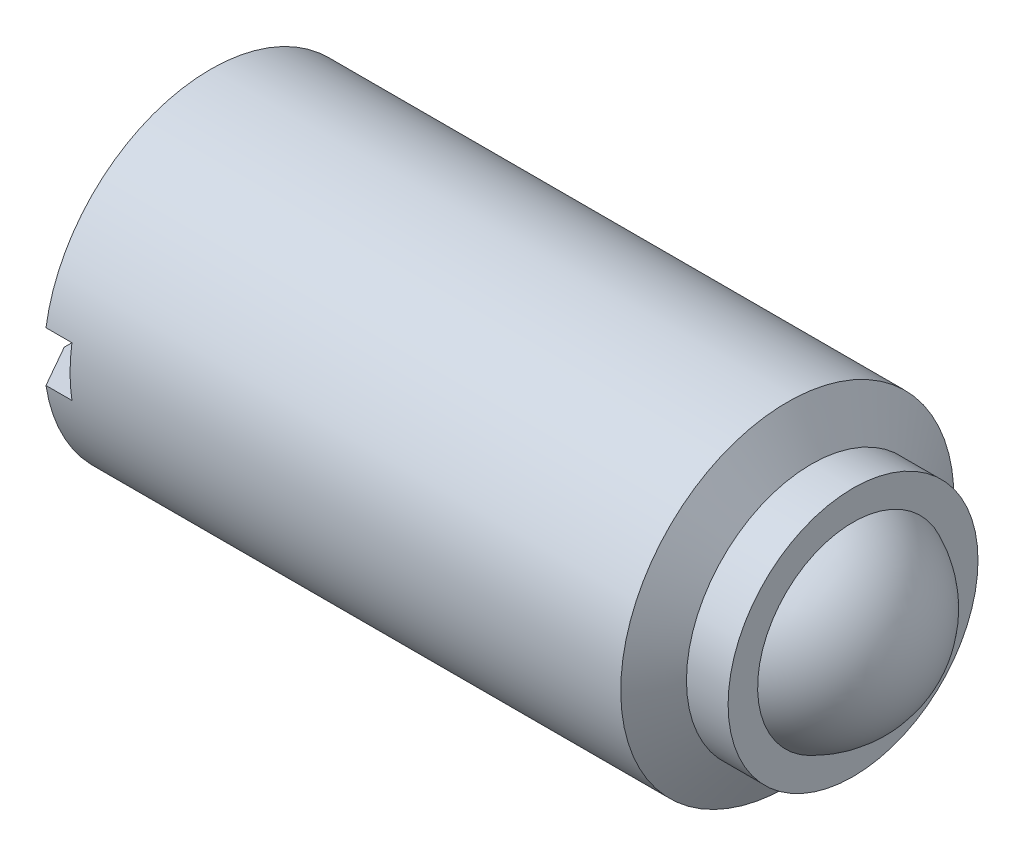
ISO-10303-21;
HEADER;
FILE_DESCRIPTION(('STEP AP214'),'2;1');
FILE_NAME('part.step','',(''),(''),'','','');
FILE_SCHEMA(('AUTOMOTIVE_DESIGN { 1 0 10303 214 1 1 1 1 }'));
ENDSEC;
DATA;
#1=APPLICATION_CONTEXT('core data for automotive mechanical design processes');
#2=APPLICATION_PROTOCOL_DEFINITION('international standard','automotive_design',2000,#1);
#3=PRODUCT_CONTEXT('',#1,'mechanical');
#4=PRODUCT('Part','Part','',(#3));
#5=PRODUCT_RELATED_PRODUCT_CATEGORY('part','',(#4));
#6=PRODUCT_DEFINITION_FORMATION('','',#4);
#7=PRODUCT_DEFINITION_CONTEXT('part definition',#1,'design');
#8=PRODUCT_DEFINITION('design','',#6,#7);
#9=PRODUCT_DEFINITION_SHAPE('','',#8);
#10=(LENGTH_UNIT() NAMED_UNIT(*) SI_UNIT(.MILLI.,.METRE.));
#11=(NAMED_UNIT(*) PLANE_ANGLE_UNIT() SI_UNIT($,.RADIAN.));
#12=(NAMED_UNIT(*) SI_UNIT($,.STERADIAN.) SOLID_ANGLE_UNIT());
#13=UNCERTAINTY_MEASURE_WITH_UNIT(LENGTH_MEASURE(1.E-05),#10,'distance_accuracy_value','');
#14=(GEOMETRIC_REPRESENTATION_CONTEXT(3) GLOBAL_UNCERTAINTY_ASSIGNED_CONTEXT((#13)) GLOBAL_UNIT_ASSIGNED_CONTEXT((#10,
#11,#12)) REPRESENTATION_CONTEXT('',''));
#15=CARTESIAN_POINT('',(0.,0.,0.));
#16=DIRECTION('',(0.,0.,1.));
#17=DIRECTION('',(1.,0.,0.));
#18=AXIS2_PLACEMENT_3D('',#15,#16,#17);
#19=CARTESIAN_POINT('',(0.,0.,0.));
#20=DIRECTION('',(1.,0.,0.));
#21=DIRECTION('',(0.,0.999999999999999,0.));
#22=AXIS2_PLACEMENT_3D('',#19,#20,#21);
#23=PLANE('',#22);
#24=CARTESIAN_POINT('',(0.,0.,0.));
#25=DIRECTION('',(-1.,0.,0.));
#26=DIRECTION('',(0.,-0.999999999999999,0.));
#27=AXIS2_PLACEMENT_3D('',#24,#25,#26);
#28=CIRCLE('',#27,3.);
#29=CARTESIAN_POINT('',(0.,-0.6,-2.93938769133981));
#30=VERTEX_POINT('',#29);
#31=CARTESIAN_POINT('',(0.,-0.600000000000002,2.93938769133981));
#32=VERTEX_POINT('',#31);
#33=EDGE_CURVE('E111',#30,#32,#28,.T.);
#34=ORIENTED_EDGE('',*,*,#33,.T.);
#35=DIRECTION('',(0.,0.,1.));
#36=VECTOR('',#35,1.);
#37=CARTESIAN_POINT('',(0.,-0.6,-4.));
#38=LINE('',#37,#36);
#39=EDGE_CURVE('E100',#30,#32,#38,.T.);
#40=ORIENTED_EDGE('',*,*,#39,.F.);
#41=EDGE_LOOP('',(#34,#40));
#42=FACE_BOUND('',#41,.T.);
#43=ADVANCED_FACE('F36',(#42),#23,.F.);
#44=CARTESIAN_POINT('',(0.577350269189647,0.,0.));
#45=DIRECTION('',(1.,0.,0.));
#46=DIRECTION('',(0.,0.999999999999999,0.));
#47=AXIS2_PLACEMENT_3D('',#44,#45,#46);
#48=CONICAL_SURFACE('',#47,4.,1.0471975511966);
#49=CARTESIAN_POINT('',(0.577350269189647,0.,0.));
#50=DIRECTION('',(-1.,0.,0.));
#51=DIRECTION('',(0.,-0.999999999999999,0.));
#52=AXIS2_PLACEMENT_3D('',#49,#50,#51);
#53=CIRCLE('',#52,4.);
#54=CARTESIAN_POINT('',(0.577350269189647,-0.599999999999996,-3.95474398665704));
#55=VERTEX_POINT('',#54);
#56=CARTESIAN_POINT('',(0.577350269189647,-0.599999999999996,3.95474398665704));
#57=VERTEX_POINT('',#56);
#58=EDGE_CURVE('E118',#55,#57,#53,.T.);
#59=ORIENTED_EDGE('',*,*,#58,.T.);
#60=CARTESIAN_POINT('',(3.36773334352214,-0.6,8.81268376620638));
#61=CARTESIAN_POINT('',(3.15323590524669,-0.6,8.44028772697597));
#62=CARTESIAN_POINT('',(2.93877319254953,-0.6,8.06787163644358));
#63=CARTESIAN_POINT('',(2.50999100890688,-0.6,7.32295456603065));
#64=CARTESIAN_POINT('',(2.29567153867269,-0.6,6.95045358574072));
#65=CARTESIAN_POINT('',(1.86728294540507,-0.6,6.20537988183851));
#66=CARTESIAN_POINT('',(1.65321379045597,-0.600000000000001,5.83280717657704));
#67=CARTESIAN_POINT('',(1.22544938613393,-0.6,5.0874490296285));
#68=CARTESIAN_POINT('',(1.01175413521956,-0.6,4.71466358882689));
#69=CARTESIAN_POINT('',(0.692608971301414,-0.6,4.1566266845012));
#70=CARTESIAN_POINT('',(0.586876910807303,-0.6,3.97153661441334));
#71=CARTESIAN_POINT('',(0.375692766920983,-0.600000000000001,3.60119447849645));
#72=CARTESIAN_POINT('',(0.270240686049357,-0.6,3.41594241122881));
#73=CARTESIAN_POINT('',(0.0597691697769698,-0.6,3.04516009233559));
#74=CARTESIAN_POINT('',(-0.0452502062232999,-0.600000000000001,2.85962980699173));
#75=CARTESIAN_POINT('',(-0.254533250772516,-0.6,2.48814806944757));
#76=CARTESIAN_POINT('',(-0.358796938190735,-0.6,2.30219662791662));
#77=CARTESIAN_POINT('',(-0.514209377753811,-0.6,2.02238544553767));
#78=CARTESIAN_POINT('',(-0.565920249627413,-0.6,1.92883819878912));
#79=CARTESIAN_POINT('',(-0.668771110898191,-0.600000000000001,1.74142204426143));
#80=CARTESIAN_POINT('',(-0.719911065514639,-0.6,1.64755311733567));
#81=CARTESIAN_POINT('',(-0.821277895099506,-0.6,1.45933909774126));
#82=CARTESIAN_POINT('',(-0.871504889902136,-0.600000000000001,1.36499406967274));
#83=CARTESIAN_POINT('',(-0.97043829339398,-0.6,1.175516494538));
#84=CARTESIAN_POINT('',(-1.0191449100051,-0.6,1.08038405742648));
#85=CARTESIAN_POINT('',(-1.0902361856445,-0.6,0.936159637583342));
#86=CARTESIAN_POINT('',(-1.11370740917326,-0.6,0.887606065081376));
#87=CARTESIAN_POINT('',(-1.15955218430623,-0.6,0.789985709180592));
#88=CARTESIAN_POINT('',(-1.18192581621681,-0.6,0.740918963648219));
#89=CARTESIAN_POINT('',(-1.22509408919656,-0.6,0.641927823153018));
#90=CARTESIAN_POINT('',(-1.24588444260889,-0.6,0.592001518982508));
#91=CARTESIAN_POINT('',(-1.28489458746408,-0.600000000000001,0.491175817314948));
#92=CARTESIAN_POINT('',(-1.30311523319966,-0.600000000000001,0.440276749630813));
#93=CARTESIAN_POINT('',(-1.34038989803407,-0.600000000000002,0.321497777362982));
#94=CARTESIAN_POINT('',(-1.35803657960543,-0.600000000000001,0.253128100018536));
#95=CARTESIAN_POINT('',(-1.37557148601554,-0.6,0.149357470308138));
#96=CARTESIAN_POINT('',(-1.37992741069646,-0.6,0.114728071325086));
#97=CARTESIAN_POINT('',(-1.38522754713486,-0.6,0.0452071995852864));
#98=CARTESIAN_POINT('',(-1.38617274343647,-0.6,0.0103158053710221));
#99=CARTESIAN_POINT('',(-1.38452744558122,-0.6,-0.0594750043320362));
#100=CARTESIAN_POINT('',(-1.38192728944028,-0.6,-0.0943741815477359));
#101=CARTESIAN_POINT('',(-1.37350279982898,-0.600000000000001,-0.16378468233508));
#102=CARTESIAN_POINT('',(-1.36767679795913,-0.600000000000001,-0.198295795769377));
#103=CARTESIAN_POINT('',(-1.35331656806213,-0.6,-0.267139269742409));
#104=CARTESIAN_POINT('',(-1.3447525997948,-0.6,-0.301465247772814));
#105=CARTESIAN_POINT('',(-1.32557531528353,-0.600000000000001,-0.369526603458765));
#106=CARTESIAN_POINT('',(-1.31496204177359,-0.600000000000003,-0.403261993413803));
#107=CARTESIAN_POINT('',(-1.29123427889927,-0.600000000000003,-0.473099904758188));
#108=CARTESIAN_POINT('',(-1.27798295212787,-0.600000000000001,-0.509155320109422));
#109=CARTESIAN_POINT('',(-1.25018281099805,-0.599999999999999,-0.580765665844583));
#110=CARTESIAN_POINT('',(-1.23563369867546,-0.6,-0.616320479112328));
#111=CARTESIAN_POINT('',(-1.19057004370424,-0.600000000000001,-0.722446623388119));
#112=CARTESIAN_POINT('',(-1.1586602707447,-0.600000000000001,-0.792421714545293));
#113=CARTESIAN_POINT('',(-1.0927112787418,-0.6,-0.931568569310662));
#114=CARTESIAN_POINT('',(-1.05866657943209,-0.6,-1.00073767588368));
#115=CARTESIAN_POINT('',(-0.989342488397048,-0.6,-1.13841035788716));
#116=CARTESIAN_POINT('',(-0.954063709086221,-0.6,-1.20691424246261));
#117=CARTESIAN_POINT('',(-0.882586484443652,-0.6,-1.34373162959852));
#118=CARTESIAN_POINT('',(-0.846385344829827,-0.6,-1.41204371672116));
#119=CARTESIAN_POINT('',(-0.773433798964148,-0.6,-1.54838420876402));
#120=CARTESIAN_POINT('',(-0.736683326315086,-0.6,-1.61641257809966));
#121=CARTESIAN_POINT('',(-0.662863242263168,-0.6,-1.75214239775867));
#122=CARTESIAN_POINT('',(-0.625794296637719,-0.6,-1.81984421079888));
#123=CARTESIAN_POINT('',(-0.551378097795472,-0.6,-1.95509099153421));
#124=CARTESIAN_POINT('',(-0.514030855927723,-0.6,-2.02263596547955));
#125=CARTESIAN_POINT('',(-0.397165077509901,-0.6,-2.23323494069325));
#126=CARTESIAN_POINT('',(-0.317285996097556,-0.6,-2.3760887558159));
#127=CARTESIAN_POINT('',(-0.156986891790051,-0.6,-2.66149275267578));
#128=CARTESIAN_POINT('',(-0.076566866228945,-0.6,-2.80404293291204));
#129=CARTESIAN_POINT('',(0.165204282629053,-0.6,-3.23141409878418));
#130=CARTESIAN_POINT('',(0.327062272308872,-0.6,-3.51594819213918));
#131=CARTESIAN_POINT('',(0.651536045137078,-0.6,-4.08489044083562));
#132=CARTESIAN_POINT('',(0.814152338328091,-0.6,-4.36929830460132));
#133=CARTESIAN_POINT('',(1.13974196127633,-0.6,-4.93790531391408));
#134=CARTESIAN_POINT('',(1.30271528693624,-0.6,-5.22210446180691));
#135=CARTESIAN_POINT('',(1.6240961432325,-0.6,-5.78204521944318));
#136=CARTESIAN_POINT('',(1.78249740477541,-0.6,-6.05779042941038));
#137=CARTESIAN_POINT('',(2.09943697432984,-0.6,-6.60920347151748));
#138=CARTESIAN_POINT('',(2.25797528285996,-0.6,-6.88487130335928));
#139=CARTESIAN_POINT('',(2.57501186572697,-0.599999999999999,-7.43591938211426));
#140=CARTESIAN_POINT('',(2.73351006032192,-0.599999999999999,-7.71129967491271));
#141=CARTESIAN_POINT('',(3.05057567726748,-0.6,-8.26201895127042));
#142=CARTESIAN_POINT('',(3.20914309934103,-0.6,-8.53735793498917));
#143=CARTESIAN_POINT('',(3.36773334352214,-0.600000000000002,-8.81268376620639));
#144=B_SPLINE_CURVE_WITH_KNOTS('',3,(#60,#61,#62,#63,#64,#65,#66,#67,#68,#69,#70,#71,#72,#73,
#74,#75,#76,#77,#78,#79,#80,#81,#82,#83,#84,#85,#86,#87,#88,#89,#90,#91,#92,#93,#94,#95,#96,#97,
#98,#99,#100,#101,#102,#103,#104,#105,#106,#107,#108,#109,#110,#111,#112,#113,#114,#115,#116,
#117,#118,#119,#120,#121,#122,#123,#124,#125,#126,#127,#128,#129,#130,#131,#132,#133,#134,#135,
#136,#137,#138,#139,#140,#141,#142,#143),.UNSPECIFIED.,.F.,.F.,(4,2,2,2,2,2,2,2,2,2,2,2,2,2,2,2,
2,2,2,2,2,2,2,2,2,2,2,2,2,2,2,2,2,2,2,2,2,2,2,2,2,4),(0.,1.28926018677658,2.57852672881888,
3.86760549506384,5.15667893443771,5.79616174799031,6.43565029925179,7.07522389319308,
7.71478146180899,8.03544518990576,8.35612834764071,8.67676910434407,8.99736581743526,
9.15914331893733,9.32090896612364,9.48309816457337,9.64523331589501,9.85628895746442,
9.96085057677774,10.0653820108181,10.1701988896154,10.2750700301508,10.3811213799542,
10.4871705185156,10.6023759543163,10.7176079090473,10.9482565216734,11.1795235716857,
11.4106774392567,11.6426088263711,11.8745684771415,12.1061249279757,12.3376719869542,
12.8286796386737,13.3196897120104,14.3017357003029,15.2845819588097,16.267416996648,
17.2214281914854,18.1754430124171,19.1286501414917,20.0818534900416),.UNSPECIFIED.);
#145=EDGE_CURVE('E59',#57,#32,#144,.T.);
#146=ORIENTED_EDGE('',*,*,#145,.T.);
#147=ORIENTED_EDGE('',*,*,#33,.F.);
#148=EDGE_CURVE('E109',#30,#55,#144,.T.);
#149=ORIENTED_EDGE('',*,*,#148,.T.);
#150=EDGE_LOOP('',(#59,#146,#147,#149));
#151=FACE_BOUND('',#150,.T.);
#152=ADVANCED_FACE('F170',(#151),#48,.T.);
#153=CARTESIAN_POINT('',(0.,0.599999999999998,2.93938769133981));
#154=VERTEX_POINT('',#153);
#155=CARTESIAN_POINT('',(0.,0.599999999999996,-2.93938769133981));
#156=VERTEX_POINT('',#155);
#157=EDGE_CURVE('E106',#154,#156,#28,.T.);
#158=ORIENTED_EDGE('',*,*,#157,.T.);
#159=DIRECTION('',(0.,0.,1.));
#160=VECTOR('',#159,1.);
#161=CARTESIAN_POINT('',(0.,0.6,-4.));
#162=LINE('',#161,#160);
#163=EDGE_CURVE('E90',#156,#154,#162,.T.);
#164=ORIENTED_EDGE('',*,*,#163,.T.);
#165=EDGE_LOOP('',(#158,#164));
#166=FACE_BOUND('',#165,.T.);
#167=ADVANCED_FACE('F38',(#166),#23,.F.);
#168=CARTESIAN_POINT('',(0.577350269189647,0.6,3.95474398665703));
#169=VERTEX_POINT('',#168);
#170=CARTESIAN_POINT('',(0.577350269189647,0.600000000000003,-3.95474398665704));
#171=VERTEX_POINT('',#170);
#172=EDGE_CURVE('E108',#169,#171,#53,.T.);
#173=ORIENTED_EDGE('',*,*,#172,.T.);
#174=CARTESIAN_POINT('',(3.36773334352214,0.599999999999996,-8.81268376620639));
#175=CARTESIAN_POINT('',(3.15323590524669,0.599999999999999,-8.44028772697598));
#176=CARTESIAN_POINT('',(2.93877319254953,0.6,-8.06787163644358));
#177=CARTESIAN_POINT('',(2.50999100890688,0.600000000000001,-7.32295456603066));
#178=CARTESIAN_POINT('',(2.2956715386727,0.6,-6.95045358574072));
#179=CARTESIAN_POINT('',(1.86728294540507,0.6,-6.20537988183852));
#180=CARTESIAN_POINT('',(1.65321379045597,0.6,-5.83280717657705));
#181=CARTESIAN_POINT('',(1.22544938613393,0.6,-5.08744902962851));
#182=CARTESIAN_POINT('',(1.01175413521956,0.6,-4.7146635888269));
#183=CARTESIAN_POINT('',(0.692608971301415,0.6,-4.1566266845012));
#184=CARTESIAN_POINT('',(0.586876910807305,0.6,-3.97153661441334));
#185=CARTESIAN_POINT('',(0.375692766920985,0.6,-3.60119447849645));
#186=CARTESIAN_POINT('',(0.270240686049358,0.6,-3.41594241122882));
#187=CARTESIAN_POINT('',(0.0597691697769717,0.6,-3.0451600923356));
#188=CARTESIAN_POINT('',(-0.0452502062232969,0.6,-2.85962980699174));
#189=CARTESIAN_POINT('',(-0.254533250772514,0.599999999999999,-2.48814806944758));
#190=CARTESIAN_POINT('',(-0.358796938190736,0.599999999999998,-2.30219662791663));
#191=CARTESIAN_POINT('',(-0.514209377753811,0.599999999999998,-2.02238544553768));
#192=CARTESIAN_POINT('',(-0.565920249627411,0.599999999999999,-1.92883819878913));
#193=CARTESIAN_POINT('',(-0.668771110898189,0.6,-1.74142204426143));
#194=CARTESIAN_POINT('',(-0.719911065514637,0.6,-1.64755311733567));
#195=CARTESIAN_POINT('',(-0.821277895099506,0.599999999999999,-1.45933909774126));
#196=CARTESIAN_POINT('',(-0.871504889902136,0.599999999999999,-1.36499406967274));
#197=CARTESIAN_POINT('',(-0.97043829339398,0.6,-1.175516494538));
#198=CARTESIAN_POINT('',(-1.0191449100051,0.6,-1.08038405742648));
#199=CARTESIAN_POINT('',(-1.0902361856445,0.6,-0.936159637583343));
#200=CARTESIAN_POINT('',(-1.11370740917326,0.6,-0.887606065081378));
#201=CARTESIAN_POINT('',(-1.15955218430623,0.599999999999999,-0.789985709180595));
#202=CARTESIAN_POINT('',(-1.18192581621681,0.599999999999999,-0.740918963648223));
#203=CARTESIAN_POINT('',(-1.22509408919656,0.599999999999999,-0.641927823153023));
#204=CARTESIAN_POINT('',(-1.24588444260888,0.599999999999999,-0.592001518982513));
#205=CARTESIAN_POINT('',(-1.28489458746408,0.6,-0.491175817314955));
#206=CARTESIAN_POINT('',(-1.30311523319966,0.6,-0.440276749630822));
#207=CARTESIAN_POINT('',(-1.34038989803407,0.6,-0.321497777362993));
#208=CARTESIAN_POINT('',(-1.35803657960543,0.599999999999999,-0.253128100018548));
#209=CARTESIAN_POINT('',(-1.37557148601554,0.6,-0.14935747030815));
#210=CARTESIAN_POINT('',(-1.37992741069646,0.6,-0.114728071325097));
#211=CARTESIAN_POINT('',(-1.38522754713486,0.599999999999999,-0.0452071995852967));
#212=CARTESIAN_POINT('',(-1.38617274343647,0.599999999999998,-0.0103158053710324));
#213=CARTESIAN_POINT('',(-1.38452744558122,0.599999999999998,0.059475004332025));
#214=CARTESIAN_POINT('',(-1.38192728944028,0.599999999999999,0.0943741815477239));
#215=CARTESIAN_POINT('',(-1.37350279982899,0.6,0.163784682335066));
#216=CARTESIAN_POINT('',(-1.36767679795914,0.6,0.198295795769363));
#217=CARTESIAN_POINT('',(-1.35331656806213,0.599999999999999,0.267139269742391));
#218=CARTESIAN_POINT('',(-1.34475259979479,0.599999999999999,0.301465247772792));
#219=CARTESIAN_POINT('',(-1.32557531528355,0.6,0.369526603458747));
#220=CARTESIAN_POINT('',(-1.31496204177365,0.6,0.403261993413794));
#221=CARTESIAN_POINT('',(-1.29123427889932,0.6,0.473099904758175));
#222=CARTESIAN_POINT('',(-1.27798295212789,0.6,0.509155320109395));
#223=CARTESIAN_POINT('',(-1.25018281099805,0.599999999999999,0.580765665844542));
#224=CARTESIAN_POINT('',(-1.23563369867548,0.599999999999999,0.616320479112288));
#225=CARTESIAN_POINT('',(-1.19057004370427,0.6,0.722446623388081));
#226=CARTESIAN_POINT('',(-1.15866027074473,0.599999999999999,0.792421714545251));
#227=CARTESIAN_POINT('',(-1.09271127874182,0.599999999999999,0.931568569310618));
#228=CARTESIAN_POINT('',(-1.05866657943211,0.599999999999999,1.00073767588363));
#229=CARTESIAN_POINT('',(-0.989342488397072,0.599999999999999,1.13841035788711));
#230=CARTESIAN_POINT('',(-0.954063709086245,0.599999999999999,1.20691424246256));
#231=CARTESIAN_POINT('',(-0.882586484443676,0.599999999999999,1.34373162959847));
#232=CARTESIAN_POINT('',(-0.846385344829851,0.599999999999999,1.41204371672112));
#233=CARTESIAN_POINT('',(-0.77343379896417,0.599999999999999,1.54838420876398));
#234=CARTESIAN_POINT('',(-0.736683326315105,0.599999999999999,1.61641257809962));
#235=CARTESIAN_POINT('',(-0.662863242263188,0.6,1.75214239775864));
#236=CARTESIAN_POINT('',(-0.625794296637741,0.6,1.81984421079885));
#237=CARTESIAN_POINT('',(-0.551378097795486,0.599999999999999,1.95509099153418));
#238=CARTESIAN_POINT('',(-0.514030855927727,0.599999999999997,2.02263596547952));
#239=CARTESIAN_POINT('',(-0.397165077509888,0.599999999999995,2.23323494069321));
#240=CARTESIAN_POINT('',(-0.317285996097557,0.599999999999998,2.37608875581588));
#241=CARTESIAN_POINT('',(-0.156986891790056,0.600000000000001,2.66149275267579));
#242=CARTESIAN_POINT('',(-0.0765668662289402,0.6,2.80404293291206));
#243=CARTESIAN_POINT('',(0.165204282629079,0.599999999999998,3.23141409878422));
#244=CARTESIAN_POINT('',(0.327062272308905,0.599999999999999,3.51594819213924));
#245=CARTESIAN_POINT('',(0.651536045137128,0.6,4.08489044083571));
#246=CARTESIAN_POINT('',(0.814152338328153,0.599999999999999,4.36929830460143));
#247=CARTESIAN_POINT('',(1.13974196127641,0.599999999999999,4.93790531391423));
#248=CARTESIAN_POINT('',(1.30271528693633,0.599999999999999,5.22210446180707));
#249=CARTESIAN_POINT('',(1.6240961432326,0.599999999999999,5.78204521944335));
#250=CARTESIAN_POINT('',(1.7824974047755,0.599999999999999,6.05779042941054));
#251=CARTESIAN_POINT('',(2.09943697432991,0.599999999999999,6.6092034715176));
#252=CARTESIAN_POINT('',(2.25797528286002,0.599999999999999,6.88487130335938));
#253=CARTESIAN_POINT('',(2.57501186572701,0.599999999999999,7.43591938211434));
#254=CARTESIAN_POINT('',(2.73351006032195,0.599999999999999,7.71129967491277));
#255=CARTESIAN_POINT('',(3.05057567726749,0.599999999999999,8.26201895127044));
#256=CARTESIAN_POINT('',(3.20914309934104,0.6,8.53735793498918));
#257=CARTESIAN_POINT('',(3.36773334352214,0.6,8.81268376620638));
#258=B_SPLINE_CURVE_WITH_KNOTS('',3,(#174,#175,#176,#177,#178,#179,#180,#181,#182,#183,#184,
#185,#186,#187,#188,#189,#190,#191,#192,#193,#194,#195,#196,#197,#198,#199,#200,#201,#202,#203,
#204,#205,#206,#207,#208,#209,#210,#211,#212,#213,#214,#215,#216,#217,#218,#219,#220,#221,#222,
#223,#224,#225,#226,#227,#228,#229,#230,#231,#232,#233,#234,#235,#236,#237,#238,#239,#240,#241,
#242,#243,#244,#245,#246,#247,#248,#249,#250,#251,#252,#253,#254,#255,#256,#257),.UNSPECIFIED.,
.F.,.F.,(4,2,2,2,2,2,2,2,2,2,2,2,2,2,2,2,2,2,2,2,2,2,2,2,2,2,2,2,2,2,2,2,2,2,2,2,2,2,2,2,2,4),
(0.,1.28926018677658,2.57852672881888,3.86760549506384,5.15667893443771,5.79616174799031,
6.43565029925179,7.07522389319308,7.71478146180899,8.03544518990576,8.35612834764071,
8.67676910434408,8.99736581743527,9.15914331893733,9.32090896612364,9.48309816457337,
9.645233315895,9.85628895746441,9.96085057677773,10.0653820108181,10.1701988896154,
10.2750700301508,10.3811213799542,10.4871705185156,10.6023759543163,10.7176079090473,
10.9482565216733,11.1795235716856,11.4106774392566,11.6426088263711,11.8745684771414,
12.1061249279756,12.3376719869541,12.8286796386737,13.3196897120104,14.301735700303,
15.2845819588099,16.2674169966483,17.2214281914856,18.1754430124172,19.1286501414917,
20.0818534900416),.UNSPECIFIED.);
#259=EDGE_CURVE('E94',#171,#156,#258,.T.);
#260=ORIENTED_EDGE('',*,*,#259,.T.);
#261=ORIENTED_EDGE('',*,*,#157,.F.);
#262=EDGE_CURVE('E96',#154,#169,#258,.T.);
#263=ORIENTED_EDGE('',*,*,#262,.T.);
#264=EDGE_LOOP('',(#173,#260,#261,#263));
#265=FACE_BOUND('',#264,.T.);
#266=ADVANCED_FACE('F105',(#265),#48,.T.);
#267=CARTESIAN_POINT('',(-23.9549897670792,0.,0.));
#268=DIRECTION('',(-1.,0.,0.));
#269=DIRECTION('',(0.,-0.999999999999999,0.));
#270=AXIS2_PLACEMENT_3D('',#267,#268,#269);
#271=CYLINDRICAL_SURFACE('',#270,4.);
#272=CARTESIAN_POINT('',(1.19999999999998,0.,0.));
#273=DIRECTION('',(1.,0.,0.));
#274=DIRECTION('',(0.,0.,-1.));
#275=AXIS2_PLACEMENT_3D('',#272,#273,#274);
#276=CIRCLE('',#275,4.);
#277=CARTESIAN_POINT('',(1.19999999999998,-0.6,-3.95474398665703));
#278=VERTEX_POINT('',#277);
#279=CARTESIAN_POINT('',(1.19999999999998,0.599999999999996,-3.95474398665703));
#280=VERTEX_POINT('',#279);
#281=EDGE_CURVE('E115',#278,#280,#276,.T.);
#282=ORIENTED_EDGE('',*,*,#281,.T.);
#283=DIRECTION('',(-1.,0.,0.));
#284=VECTOR('',#283,1.);
#285=CARTESIAN_POINT('',(-23.9549897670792,0.600000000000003,-3.95474398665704));
#286=LINE('',#285,#284);
#287=EDGE_CURVE('E11',#280,#171,#286,.T.);
#288=ORIENTED_EDGE('',*,*,#287,.T.);
#289=ORIENTED_EDGE('',*,*,#172,.F.);
#290=DIRECTION('',(-1.,0.,0.));
#291=VECTOR('',#290,1.);
#292=CARTESIAN_POINT('',(-23.9549897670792,0.600000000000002,3.95474398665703));
#293=LINE('',#292,#291);
#294=CARTESIAN_POINT('',(1.19999999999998,0.600000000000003,3.95474398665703));
#295=VERTEX_POINT('',#294);
#296=EDGE_CURVE('E44',#169,#295,#293,.F.);
#297=ORIENTED_EDGE('',*,*,#296,.T.);
#298=CARTESIAN_POINT('',(1.19999999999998,-0.599999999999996,3.95474398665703));
#299=VERTEX_POINT('',#298);
#300=EDGE_CURVE('E51',#295,#299,#276,.T.);
#301=ORIENTED_EDGE('',*,*,#300,.T.);
#302=DIRECTION('',(-1.,0.,0.));
#303=VECTOR('',#302,1.);
#304=CARTESIAN_POINT('',(-23.9549897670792,-0.599999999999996,3.95474398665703));
#305=LINE('',#304,#303);
#306=EDGE_CURVE('E113',#299,#57,#305,.T.);
#307=ORIENTED_EDGE('',*,*,#306,.T.);
#308=ORIENTED_EDGE('',*,*,#58,.F.);
#309=DIRECTION('',(-1.,0.,0.));
#310=VECTOR('',#309,1.);
#311=CARTESIAN_POINT('',(-23.9549897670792,-0.599999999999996,-3.95474398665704));
#312=LINE('',#311,#310);
#313=EDGE_CURVE('E122',#55,#278,#312,.F.);
#314=ORIENTED_EDGE('',*,*,#313,.T.);
#315=EDGE_LOOP('',(#282,#288,#289,#297,#301,#307,#308,#314));
#316=FACE_BOUND('',#315,.T.);
#317=CARTESIAN_POINT('',(14.4226497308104,0.,0.));
#318=DIRECTION('',(-1.,0.,0.));
#319=DIRECTION('',(0.,-0.999999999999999,0.));
#320=AXIS2_PLACEMENT_3D('',#317,#318,#319);
#321=CIRCLE('',#320,4.);
#322=CARTESIAN_POINT('',(14.4226497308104,-4.,0.));
#323=VERTEX_POINT('',#322);
#324=EDGE_CURVE('E240',#323,#323,#321,.T.);
#325=ORIENTED_EDGE('',*,*,#324,.T.);
#326=EDGE_LOOP('',(#325));
#327=FACE_BOUND('',#326,.T.);
#328=ADVANCED_FACE('F126',(#316,#327),#271,.T.);
#329=CARTESIAN_POINT('',(15.,0.,0.));
#330=DIRECTION('',(-1.,0.,0.));
#331=DIRECTION('',(0.,-0.999999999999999,0.));
#332=AXIS2_PLACEMENT_3D('',#329,#330,#331);
#333=CONICAL_SURFACE('',#332,3.,1.0471975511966);
#334=ORIENTED_EDGE('',*,*,#324,.F.);
#335=EDGE_LOOP('',(#334));
#336=FACE_BOUND('',#335,.T.);
#337=CARTESIAN_POINT('',(15.,0.,0.));
#338=DIRECTION('',(-1.,0.,0.));
#339=DIRECTION('',(0.,-0.999999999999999,0.));
#340=AXIS2_PLACEMENT_3D('',#337,#338,#339);
#341=CIRCLE('',#340,3.);
#342=CARTESIAN_POINT('',(15.,-3.,0.));
#343=VERTEX_POINT('',#342);
#344=EDGE_CURVE('E236',#343,#343,#341,.T.);
#345=ORIENTED_EDGE('',*,*,#344,.T.);
#346=EDGE_LOOP('',(#345));
#347=FACE_BOUND('',#346,.T.);
#348=ADVANCED_FACE('F162',(#336,#347),#333,.T.);
#349=CARTESIAN_POINT('',(-23.9549897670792,0.,0.));
#350=DIRECTION('',(-1.,0.,0.));
#351=DIRECTION('',(0.,-0.999999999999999,0.));
#352=AXIS2_PLACEMENT_3D('',#349,#350,#351);
#353=CYLINDRICAL_SURFACE('',#352,3.);
#354=ORIENTED_EDGE('',*,*,#344,.F.);
#355=EDGE_LOOP('',(#354));
#356=FACE_BOUND('',#355,.T.);
#357=CARTESIAN_POINT('',(16.,0.,0.));
#358=DIRECTION('',(-1.,0.,0.));
#359=DIRECTION('',(0.,-0.999999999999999,0.));
#360=AXIS2_PLACEMENT_3D('',#357,#358,#359);
#361=CIRCLE('',#360,3.);
#362=CARTESIAN_POINT('',(16.,-3.,0.));
#363=VERTEX_POINT('',#362);
#364=EDGE_CURVE('E232',#363,#363,#361,.T.);
#365=ORIENTED_EDGE('',*,*,#364,.T.);
#366=EDGE_LOOP('',(#365));
#367=FACE_BOUND('',#366,.T.);
#368=ADVANCED_FACE('F158',(#356,#367),#353,.T.);
#369=CARTESIAN_POINT('',(16.,3.,0.));
#370=DIRECTION('',(-1.,0.,0.));
#371=DIRECTION('',(0.,-0.999999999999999,0.));
#372=AXIS2_PLACEMENT_3D('',#369,#370,#371);
#373=PLANE('',#372);
#374=ORIENTED_EDGE('',*,*,#364,.F.);
#375=EDGE_LOOP('',(#374));
#376=FACE_BOUND('',#375,.T.);
#377=CARTESIAN_POINT('',(16.,0.,0.));
#378=DIRECTION('',(-1.,0.,0.));
#379=DIRECTION('',(0.,-0.999999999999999,0.));
#380=AXIS2_PLACEMENT_3D('',#377,#378,#379);
#381=CIRCLE('',#380,2.29128784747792);
#382=CARTESIAN_POINT('',(16.,-2.29128784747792,0.));
#383=VERTEX_POINT('',#382);
#384=EDGE_CURVE('E230',#383,#383,#381,.T.);
#385=ORIENTED_EDGE('',*,*,#384,.T.);
#386=EDGE_LOOP('',(#385));
#387=FACE_BOUND('',#386,.T.);
#388=ADVANCED_FACE('F154',(#376,#387),#373,.F.);
#389=CARTESIAN_POINT('',(15.,0.,0.));
#390=DIRECTION('',(-1.,0.,0.));
#391=DIRECTION('',(0.,-0.999999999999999,0.));
#392=AXIS2_PLACEMENT_3D('',#389,#390,#391);
#393=SPHERICAL_SURFACE('',#392,2.5);
#394=ORIENTED_EDGE('',*,*,#384,.F.);
#395=EDGE_LOOP('',(#394));
#396=FACE_BOUND('',#395,.T.);
#397=ADVANCED_FACE('F151',(#396),#393,.T.);
#398=CARTESIAN_POINT('',(1.19999999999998,0.6,-4.));
#399=DIRECTION('',(1.,0.,0.));
#400=DIRECTION('',(0.,0.,-1.));
#401=AXIS2_PLACEMENT_3D('',#398,#399,#400);
#402=PLANE('',#401);
#403=DIRECTION('',(0.,0.,1.));
#404=VECTOR('',#403,1.);
#405=CARTESIAN_POINT('',(1.19999999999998,0.6,-4.));
#406=LINE('',#405,#404);
#407=EDGE_CURVE('E101',#280,#295,#406,.T.);
#408=ORIENTED_EDGE('',*,*,#407,.F.);
#409=ORIENTED_EDGE('',*,*,#281,.F.);
#410=DIRECTION('',(0.,0.,1.));
#411=VECTOR('',#410,1.);
#412=CARTESIAN_POINT('',(1.19999999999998,-0.6,-4.));
#413=LINE('',#412,#411);
#414=EDGE_CURVE('E128',#278,#299,#413,.T.);
#415=ORIENTED_EDGE('',*,*,#414,.T.);
#416=ORIENTED_EDGE('',*,*,#300,.F.);
#417=EDGE_LOOP('',(#408,#409,#415,#416));
#418=FACE_BOUND('',#417,.T.);
#419=ADVANCED_FACE('F148',(#418),#402,.F.);
#420=CARTESIAN_POINT('',(1.19999999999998,-0.6,-4.));
#421=DIRECTION('',(0.,-0.999999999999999,0.));
#422=DIRECTION('',(0.,0.,-1.));
#423=AXIS2_PLACEMENT_3D('',#420,#421,#422);
#424=PLANE('',#423);
#425=ORIENTED_EDGE('',*,*,#306,.F.);
#426=ORIENTED_EDGE('',*,*,#414,.F.);
#427=ORIENTED_EDGE('',*,*,#313,.F.);
#428=ORIENTED_EDGE('',*,*,#148,.F.);
#429=ORIENTED_EDGE('',*,*,#39,.T.);
#430=ORIENTED_EDGE('',*,*,#145,.F.);
#431=EDGE_LOOP('',(#425,#426,#427,#428,#429,#430));
#432=FACE_BOUND('',#431,.T.);
#433=ADVANCED_FACE('F146',(#432),#424,.F.);
#434=CARTESIAN_POINT('',(1.19999999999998,0.6,-4.));
#435=DIRECTION('',(0.,0.999999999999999,0.));
#436=DIRECTION('',(0.,0.,1.));
#437=AXIS2_PLACEMENT_3D('',#434,#435,#436);
#438=PLANE('',#437);
#439=ORIENTED_EDGE('',*,*,#287,.F.);
#440=ORIENTED_EDGE('',*,*,#407,.T.);
#441=ORIENTED_EDGE('',*,*,#296,.F.);
#442=ORIENTED_EDGE('',*,*,#262,.F.);
#443=ORIENTED_EDGE('',*,*,#163,.F.);
#444=ORIENTED_EDGE('',*,*,#259,.F.);
#445=EDGE_LOOP('',(#439,#440,#441,#442,#443,#444));
#446=FACE_BOUND('',#445,.T.);
#447=ADVANCED_FACE('F93',(#446),#438,.F.);
#448=CLOSED_SHELL('',(#43,#152,#167,#266,#328,#348,#368,#388,#397,#419,#433,#447));
#449=MANIFOLD_SOLID_BREP('B2',#448);
#450=ADVANCED_BREP_SHAPE_REPRESENTATION('',(#18,#449),#14);
#451=SHAPE_DEFINITION_REPRESENTATION(#9,#450);
ENDSEC;
END-ISO-10303-21;
